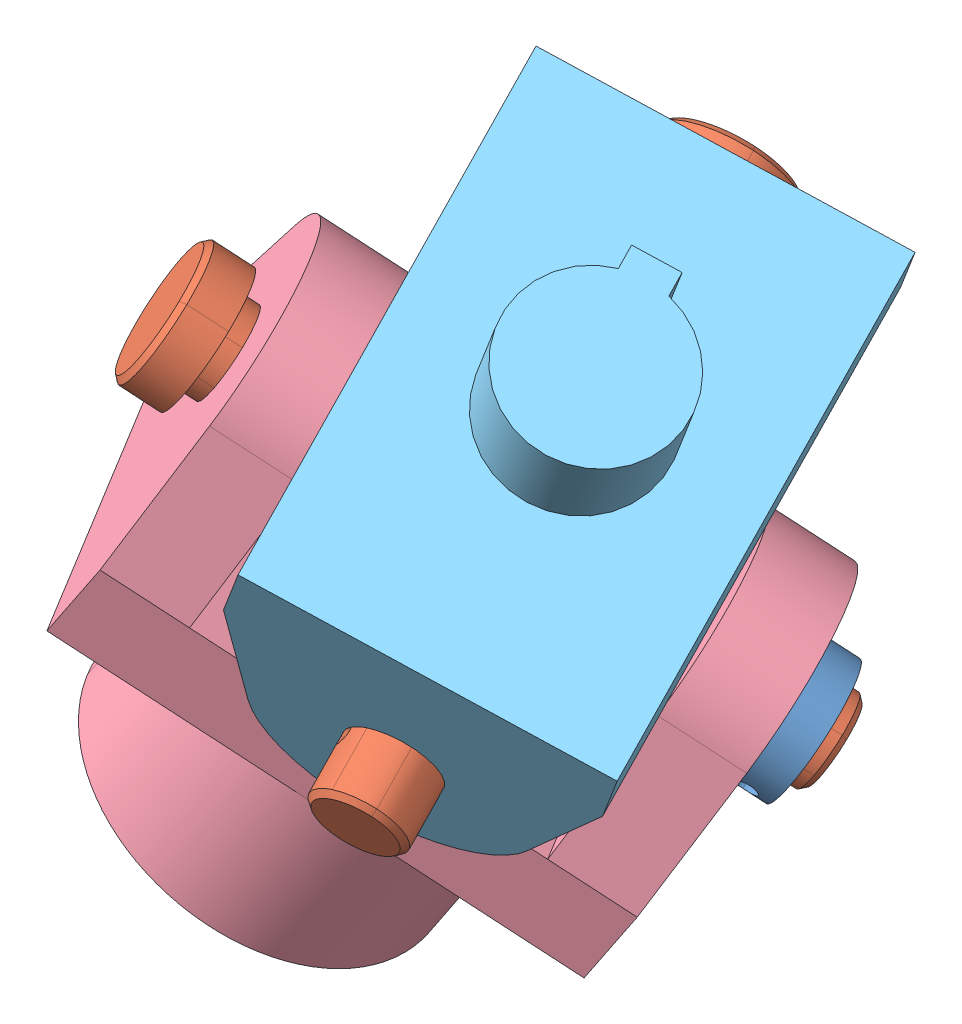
SolidWorks assembly uNIVERSAL jOINT.sldasm, configuration Default (file format 9000). Lengths in mm.
Overall size (77.56 85.94 63.09).
9 component instances, 6 part files, 11 mates.
Components (placement in the parent):
- pn-1: pn.sldprt [Default] at (83.4958 3.5858 214.3805) x (0.706129 0.433009 0.560254) z (-0.486564 -0.278109 0.828197) (suppressed, hidden)
- pn-2: pn.sldprt [Default] at (109.1409 5.6918 241.0021) x (0.64117 0.767199 0.017522) z (-0.766969 0.641408 -0.018818) (suppressed, hidden)
- bush-1: bush.sldprt [Default] at (113.0712 5.5744 143.8822) x (-0.693211 -0.633074 -0.344493) z (-0.108666 0.564315 -0.818377) size (13.56 4.18 13.26)
- bush-2: bush.sldprt [Default] at (98.1374 30.7145 153.7149) x (-0.666736 -0.711616 -0.221509) z (-0.715108 0.527095 0.459121) size (13.56 4.18 13.26)
- bolt-1: bolt.sldprt [Default] at (88.0975 52.9266 112.5764) x (0.209961 -0.464515 0.860315) z (0.666736 0.711616 0.221509) size (56.5 12 12)
- bolt-2: bolt.sldprt [Default] at (54.1789 49.3717 181.9027) x (0.712496 -0.529873 -0.459983) z (0.693211 0.633074 0.344493) size (56.5 12 12)
- U J P2-1: U J P2.sldprt [Default] at (102.8192 31.3106 160.2801) x (-0.669527 -0.70955 -0.219712) z (0.712496 -0.529873 -0.459983) size (22.5 30 30)
- Universal joint part2-1: Universal joint part2.sldprt [Default] at (89.7856 15.572 158.1407) x (0.491091 -0.091664 0.866272) z (-0.501178 -0.843109 0.194906) size (30 45 44)
- universal joint upper-1: universal joint upper.SLDPRT [Default] at (102.5081 32.5968 161.0937) x (0.838339 -0.367246 -0.402887) z (0.503095 0.805826 0.312313) size (30.1 45 39.23)
Mates (geometry in assembly coordinates):
- Concentric2: concentric aligned: cylinder of bush-2 through (99.3939 27.9348 158.8631) axis (-0.209961 0.464515 -0.860315) radius 4; cylinder of bolt-1 through (105.298 14.8726 183.0553) axis (-0.209961 0.464515 -0.860315) radius 4
- Concentric3: concentric anti-aligned: cylinder of bolt-1 through (105.298 14.8726 183.0553) axis (-0.209961 0.464515 -0.860315) radius 4; cylinder of U J P2-1 through (96.3222 34.7306 146.2768) axis (0.209961 -0.464515 0.860315) radius 2.5
- Width3: width anti-aligned: plane of U J P2-1 through (108.9976 14.1688 156.9866) normal (0.712496 -0.529873 -0.459983); plane of U J P2-1 through (87.6227 30.065 170.7861) normal (-0.712496 0.529873 0.459983); plane of Universal joint part2-1 through (116.6816 21.188 160.8031) normal (-0.712496 0.529873 0.459983); plane of Universal joint part2-1 through (80.574 39.8341 148.6144) normal (0.712496 -0.529873 -0.459983)
- Concentric4: concentric anti-aligned: cylinder of U J P2-1 through (103.4638 12.7193 150.0847) axis (-0.712496 0.529873 0.459983) radius 2.5; cylinder of Universal joint part2-1 through (103.4638 12.7193 150.0847) axis (0.712496 -0.529873 -0.459983) radius 4
- Concentric5: concentric anti-aligned: cylinder of bolt-2 through (112.5481 5.9634 144.2199) axis (-0.712496 0.529873 0.459983) radius 4; cylinder of Universal joint part2-1 through (103.4638 12.7193 150.0847) axis (0.712496 -0.529873 -0.459983) radius 4
- Concentric6: concentric anti-aligned: cylinder of bush-1 through (108.8075 8.7452 146.6348) axis (0.712496 -0.529873 -0.459983) radius 4; cylinder of bolt-2 through (112.5481 5.9634 144.2199) axis (-0.712496 0.529873 0.459983) radius 4
- Coincident2: coincident anti-aligned: plane of bush-1 through (113.2178 9.1234 153.0306) normal (-0.712496 0.529873 0.459983); plane of Universal joint part2-1 through (107.3202 20.0103 131.3544) normal (0.712496 -0.529873 -0.459983)
- Width4: width anti-aligned: plane of bolt-2 through (115.7216 5.8834 148.1408) normal (0.712496 -0.529873 -0.459983); plane of bolt-2 through (77.0728 35.9409 176.4815) normal (-0.712496 0.529873 0.459983); plane of Universal joint part2-1 through (60.6082 19.2101 157.7508) normal (-0.712496 0.529873 0.459983); plane of Universal joint part2-1 through (107.3202 20.0103 131.3544) normal (0.712496 -0.529873 -0.459983)
- Width5: width aligned: plane of universal joint upper-1 through (96.8165 11.5364 168.5037) normal (-0.209961 0.464515 -0.860315); plane of universal joint upper-1 through (90.5555 25.4553 142.6761) normal (0.209961 -0.464515 0.860315); plane of U J P2-1 through (96.1717 42.6022 150.5637) normal (-0.209961 0.464515 -0.860315); plane of U J P2-1 through (102.4706 28.6667 176.3731) normal (0.209961 -0.464515 0.860315)
- Concentric7: concentric anti-aligned: cylinder of bolt-1 through (105.298 14.8726 183.0553) axis (-0.209961 0.464515 -0.860315) radius 4; cylinder of universal joint upper-1 through (104.1957 17.3113 178.5386) axis (0.209961 -0.464515 0.860315) radius 4
- Width6: width anti-aligned: plane of bolt-1 through (105.163 19.0279 185.913) normal (0.209961 -0.464515 0.860315); plane of bolt-1 through (93.1809 47.7671 138.681) normal (-0.209961 0.464515 -0.860315); plane of universal joint upper-1 through (88.9807 28.9392 136.2238) normal (-0.209961 0.464515 -0.860315); plane of universal joint upper-1 through (98.3912 8.0526 174.9561) normal (0.209961 -0.464515 0.860315)
